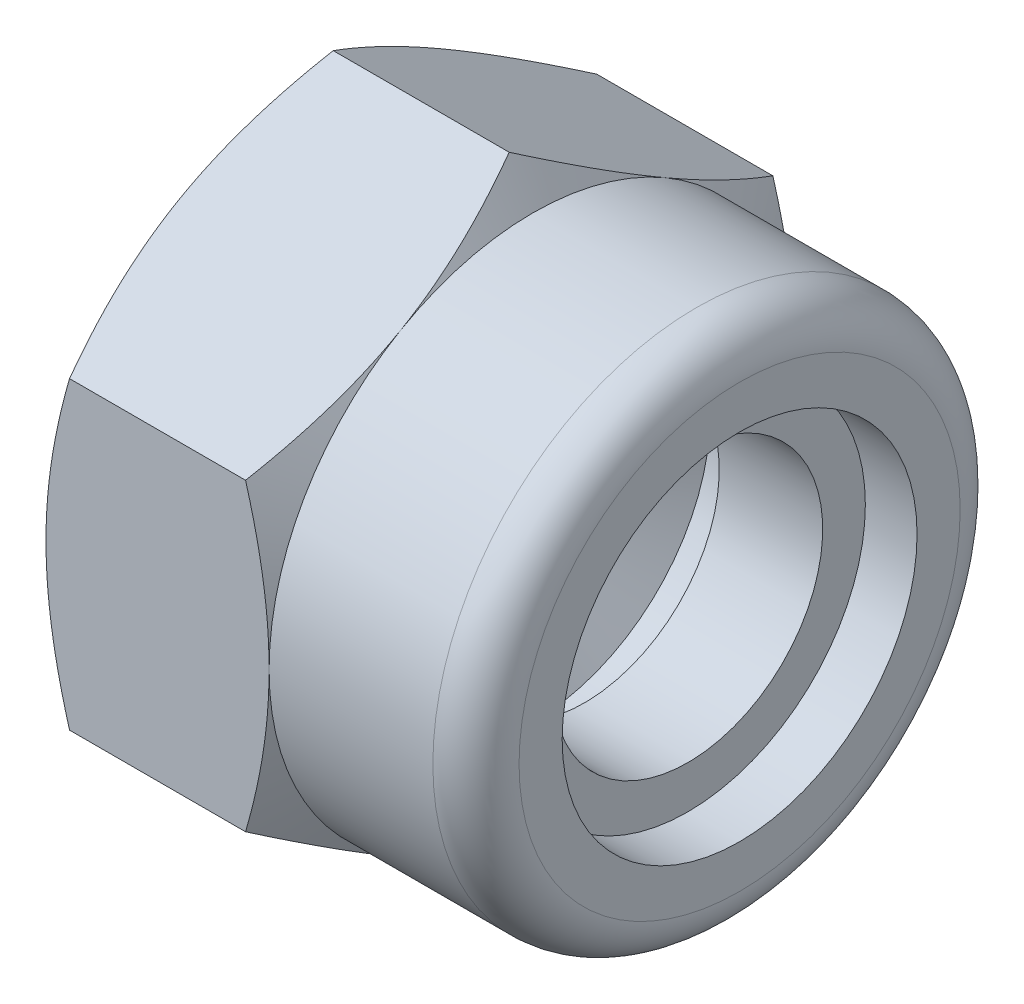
ISO-10303-21;
HEADER;
FILE_DESCRIPTION(('STEP AP214'),'2;1');
FILE_NAME('part.step','',(''),(''),'','','');
FILE_SCHEMA(('AUTOMOTIVE_DESIGN { 1 0 10303 214 1 1 1 1 }'));
ENDSEC;
DATA;
#1=APPLICATION_CONTEXT('core data for automotive mechanical design processes');
#2=APPLICATION_PROTOCOL_DEFINITION('international standard','automotive_design',2000,#1);
#3=PRODUCT_CONTEXT('',#1,'mechanical');
#4=PRODUCT('Part','Part','',(#3));
#5=PRODUCT_RELATED_PRODUCT_CATEGORY('part','',(#4));
#6=PRODUCT_DEFINITION_FORMATION('','',#4);
#7=PRODUCT_DEFINITION_CONTEXT('part definition',#1,'design');
#8=PRODUCT_DEFINITION('design','',#6,#7);
#9=PRODUCT_DEFINITION_SHAPE('','',#8);
#10=(LENGTH_UNIT() NAMED_UNIT(*) SI_UNIT(.MILLI.,.METRE.));
#11=(NAMED_UNIT(*) PLANE_ANGLE_UNIT() SI_UNIT($,.RADIAN.));
#12=(NAMED_UNIT(*) SI_UNIT($,.STERADIAN.) SOLID_ANGLE_UNIT());
#13=UNCERTAINTY_MEASURE_WITH_UNIT(LENGTH_MEASURE(1.E-05),#10,'distance_accuracy_value','');
#14=(GEOMETRIC_REPRESENTATION_CONTEXT(3) GLOBAL_UNCERTAINTY_ASSIGNED_CONTEXT((#13)) GLOBAL_UNIT_ASSIGNED_CONTEXT((#10,
#11,#12)) REPRESENTATION_CONTEXT('',''));
#15=CARTESIAN_POINT('',(0.,0.,0.));
#16=DIRECTION('',(0.,0.,1.));
#17=DIRECTION('',(1.,0.,0.));
#18=AXIS2_PLACEMENT_3D('',#15,#16,#17);
#19=CARTESIAN_POINT('',(4.89291619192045,0.,0.));
#20=DIRECTION('',(1.,0.,0.));
#21=DIRECTION('',(0.,0.,-1.));
#22=AXIS2_PLACEMENT_3D('',#19,#20,#21);
#23=CONICAL_SURFACE('',#22,3.32349999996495,1.04719755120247);
#24=CARTESIAN_POINT('',(5.5,0.,0.));
#25=DIRECTION('',(1.,0.,0.));
#26=DIRECTION('',(0.,1.,0.));
#27=AXIS2_PLACEMENT_3D('',#24,#25,#26);
#28=CIRCLE('',#27,4.375);
#29=CARTESIAN_POINT('',(5.5,4.375,0.));
#30=VERTEX_POINT('',#29);
#31=EDGE_CURVE('E361',#30,#30,#28,.F.);
#32=ORIENTED_EDGE('',*,*,#31,.F.);
#33=EDGE_LOOP('',(#32));
#34=FACE_BOUND('',#33,.T.);
#35=CARTESIAN_POINT('',(4.89291619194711,0.,0.));
#36=DIRECTION('',(1.,0.,0.));
#37=DIRECTION('',(0.,1.,0.));
#38=AXIS2_PLACEMENT_3D('',#35,#36,#37);
#39=CIRCLE('',#38,3.3235);
#40=CARTESIAN_POINT('',(4.89291619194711,3.3235,0.));
#41=VERTEX_POINT('',#40);
#42=EDGE_CURVE('E359',#41,#41,#39,.T.);
#43=ORIENTED_EDGE('',*,*,#42,.F.);
#44=EDGE_LOOP('',(#43));
#45=FACE_BOUND('',#44,.T.);
#46=ADVANCED_FACE('F16',(#34,#45),#23,.F.);
#47=CARTESIAN_POINT('',(6.775,0.,0.));
#48=DIRECTION('',(-1.,0.,0.));
#49=DIRECTION('',(0.,0.,1.));
#50=AXIS2_PLACEMENT_3D('',#47,#48,#49);
#51=CYLINDRICAL_SURFACE('',#50,4.375);
#52=CARTESIAN_POINT('',(6.775,0.,0.));
#53=DIRECTION('',(-1.,0.,0.));
#54=DIRECTION('',(0.,0.,1.));
#55=AXIS2_PLACEMENT_3D('',#52,#53,#54);
#56=CIRCLE('',#55,4.375);
#57=CARTESIAN_POINT('',(6.775,0.,4.375));
#58=VERTEX_POINT('',#57);
#59=EDGE_CURVE('E19',#58,#58,#56,.T.);
#60=ORIENTED_EDGE('',*,*,#59,.F.);
#61=EDGE_LOOP('',(#60));
#62=FACE_BOUND('',#61,.T.);
#63=ORIENTED_EDGE('',*,*,#31,.T.);
#64=EDGE_LOOP('',(#63));
#65=FACE_BOUND('',#64,.T.);
#66=ADVANCED_FACE('F365',(#62,#65),#51,.F.);
#67=CARTESIAN_POINT('',(4.89291619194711,0.,0.));
#68=DIRECTION('',(-1.,0.,0.));
#69=DIRECTION('',(0.,-1.,0.));
#70=AXIS2_PLACEMENT_3D('',#67,#68,#69);
#71=CYLINDRICAL_SURFACE('',#70,3.3235);
#72=ORIENTED_EDGE('',*,*,#42,.T.);
#73=EDGE_LOOP('',(#72));
#74=FACE_BOUND('',#73,.T.);
#75=CARTESIAN_POINT('',(0.60708380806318,0.,0.));
#76=DIRECTION('',(-1.,0.,0.));
#77=DIRECTION('',(0.,1.,0.));
#78=AXIS2_PLACEMENT_3D('',#75,#76,#77);
#79=CIRCLE('',#78,3.3235000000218);
#80=CARTESIAN_POINT('',(0.60708380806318,3.3235000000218,0.));
#81=VERTEX_POINT('',#80);
#82=EDGE_CURVE('E355',#81,#81,#79,.F.);
#83=ORIENTED_EDGE('',*,*,#82,.F.);
#84=EDGE_LOOP('',(#83));
#85=FACE_BOUND('',#84,.T.);
#86=ADVANCED_FACE('F371',(#74,#85),#71,.F.);
#87=CARTESIAN_POINT('',(6.775,3.84925,0.));
#88=DIRECTION('',(-1.,0.,0.));
#89=DIRECTION('',(0.,0.,1.));
#90=AXIS2_PLACEMENT_3D('',#87,#88,#89);
#91=PLANE('',#90);
#92=ORIENTED_EDGE('',*,*,#59,.T.);
#93=EDGE_LOOP('',(#92));
#94=FACE_BOUND('',#93,.T.);
#95=CARTESIAN_POINT('',(6.775,0.,0.));
#96=DIRECTION('',(-1.,0.,0.));
#97=DIRECTION('',(0.,0.,1.));
#98=AXIS2_PLACEMENT_3D('',#95,#96,#97);
#99=CIRCLE('',#98,3.3235);
#100=CARTESIAN_POINT('',(6.775,0.,3.3235));
#101=VERTEX_POINT('',#100);
#102=EDGE_CURVE('E358',#101,#101,#99,.T.);
#103=ORIENTED_EDGE('',*,*,#102,.F.);
#104=EDGE_LOOP('',(#103));
#105=FACE_BOUND('',#104,.T.);
#106=ADVANCED_FACE('F374',(#94,#105),#91,.T.);
#107=CARTESIAN_POINT('',(0.607083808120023,0.,0.));
#108=DIRECTION('',(-1.,0.,0.));
#109=DIRECTION('',(0.,-1.,0.));
#110=AXIS2_PLACEMENT_3D('',#107,#108,#109);
#111=CONICAL_SURFACE('',#110,3.32349999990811,1.04719755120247);
#112=ORIENTED_EDGE('',*,*,#82,.T.);
#113=EDGE_LOOP('',(#112));
#114=FACE_BOUND('',#113,.T.);
#115=CARTESIAN_POINT('',(-6.56373826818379E-11,0.,0.));
#116=DIRECTION('',(-1.,0.,0.));
#117=DIRECTION('',(0.,-1.,0.));
#118=AXIS2_PLACEMENT_3D('',#115,#116,#117);
#119=CIRCLE('',#118,4.37500000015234);
#120=CARTESIAN_POINT('',(-6.56376681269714E-11,-4.37500000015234,0.));
#121=VERTEX_POINT('',#120);
#122=EDGE_CURVE('E385',#121,#121,#119,.F.);
#123=ORIENTED_EDGE('',*,*,#122,.F.);
#124=EDGE_LOOP('',(#123));
#125=FACE_BOUND('',#124,.T.);
#126=ADVANCED_FACE('F378',(#114,#125),#111,.F.);
#127=CARTESIAN_POINT('',(9.325,0.,0.));
#128=DIRECTION('',(-1.,0.,0.));
#129=DIRECTION('',(0.,0.,1.));
#130=AXIS2_PLACEMENT_3D('',#127,#128,#129);
#131=CYLINDRICAL_SURFACE('',#130,3.3235);
#132=CARTESIAN_POINT('',(9.325,0.,0.));
#133=DIRECTION('',(-1.,0.,0.));
#134=DIRECTION('',(0.,0.,1.));
#135=AXIS2_PLACEMENT_3D('',#132,#133,#134);
#136=CIRCLE('',#135,3.3235);
#137=CARTESIAN_POINT('',(9.325,0.,3.3235));
#138=VERTEX_POINT('',#137);
#139=EDGE_CURVE('E114',#138,#138,#136,.T.);
#140=ORIENTED_EDGE('',*,*,#139,.F.);
#141=EDGE_LOOP('',(#140));
#142=FACE_BOUND('',#141,.T.);
#143=ORIENTED_EDGE('',*,*,#102,.T.);
#144=EDGE_LOOP('',(#143));
#145=FACE_BOUND('',#144,.T.);
#146=ADVANCED_FACE('F381',(#142,#145),#131,.F.);
#147=CARTESIAN_POINT('',(0.,5.4375,0.));
#148=DIRECTION('',(-1.,0.,0.));
#149=DIRECTION('',(0.,-1.,0.));
#150=AXIS2_PLACEMENT_3D('',#147,#148,#149);
#151=PLANE('',#150);
#152=CARTESIAN_POINT('',(0.,0.,0.));
#153=DIRECTION('',(1.,0.,0.));
#154=DIRECTION('',(0.,1.,0.));
#155=AXIS2_PLACEMENT_3D('',#152,#153,#154);
#156=CIRCLE('',#155,6.5);
#157=CARTESIAN_POINT('',(0.,0.,6.5));
#158=VERTEX_POINT('',#157);
#159=CARTESIAN_POINT('',(0.,-5.62916512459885,3.25));
#160=VERTEX_POINT('',#159);
#161=EDGE_CURVE('E131',#158,#160,#156,.T.);
#162=ORIENTED_EDGE('',*,*,#161,.F.);
#163=CARTESIAN_POINT('',(0.,0.,0.));
#164=DIRECTION('',(1.,0.,0.));
#165=DIRECTION('',(0.,1.,0.));
#166=AXIS2_PLACEMENT_3D('',#163,#164,#165);
#167=CIRCLE('',#166,6.5);
#168=CARTESIAN_POINT('',(0.,5.62916512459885,3.25));
#169=VERTEX_POINT('',#168);
#170=EDGE_CURVE('E132',#169,#158,#167,.T.);
#171=ORIENTED_EDGE('',*,*,#170,.F.);
#172=CARTESIAN_POINT('',(0.,0.,0.));
#173=DIRECTION('',(1.,0.,0.));
#174=DIRECTION('',(0.,1.,0.));
#175=AXIS2_PLACEMENT_3D('',#172,#173,#174);
#176=CIRCLE('',#175,6.5);
#177=CARTESIAN_POINT('',(0.,5.62916512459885,-3.25));
#178=VERTEX_POINT('',#177);
#179=EDGE_CURVE('E109',#178,#169,#176,.T.);
#180=ORIENTED_EDGE('',*,*,#179,.F.);
#181=CARTESIAN_POINT('',(0.,0.,0.));
#182=DIRECTION('',(1.,0.,0.));
#183=DIRECTION('',(0.,1.,0.));
#184=AXIS2_PLACEMENT_3D('',#181,#182,#183);
#185=CIRCLE('',#184,6.5);
#186=CARTESIAN_POINT('',(0.,0.,-6.5));
#187=VERTEX_POINT('',#186);
#188=EDGE_CURVE('E101',#187,#178,#185,.T.);
#189=ORIENTED_EDGE('',*,*,#188,.F.);
#190=CARTESIAN_POINT('',(0.,0.,0.));
#191=DIRECTION('',(1.,0.,0.));
#192=DIRECTION('',(0.,1.,0.));
#193=AXIS2_PLACEMENT_3D('',#190,#191,#192);
#194=CIRCLE('',#193,6.5);
#195=CARTESIAN_POINT('',(0.,-5.62916512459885,-3.25));
#196=VERTEX_POINT('',#195);
#197=EDGE_CURVE('E106',#196,#187,#194,.T.);
#198=ORIENTED_EDGE('',*,*,#197,.F.);
#199=CARTESIAN_POINT('',(0.,0.,0.));
#200=DIRECTION('',(1.,0.,0.));
#201=DIRECTION('',(0.,1.,0.));
#202=AXIS2_PLACEMENT_3D('',#199,#200,#201);
#203=CIRCLE('',#202,6.5);
#204=EDGE_CURVE('E123',#160,#196,#203,.T.);
#205=ORIENTED_EDGE('',*,*,#204,.F.);
#206=EDGE_LOOP('',(#162,#171,#180,#189,#198,#205));
#207=FACE_BOUND('',#206,.T.);
#208=ORIENTED_EDGE('',*,*,#122,.T.);
#209=EDGE_LOOP('',(#208));
#210=FACE_BOUND('',#209,.T.);
#211=ADVANCED_FACE('F103',(#207,#210),#151,.T.);
#212=CARTESIAN_POINT('',(9.325,3.84925,0.));
#213=DIRECTION('',(1.,0.,0.));
#214=DIRECTION('',(0.,0.,-1.));
#215=AXIS2_PLACEMENT_3D('',#212,#213,#214);
#216=PLANE('',#215);
#217=ORIENTED_EDGE('',*,*,#139,.T.);
#218=EDGE_LOOP('',(#217));
#219=FACE_BOUND('',#218,.T.);
#220=CARTESIAN_POINT('',(9.325,0.,0.));
#221=DIRECTION('',(-1.,0.,0.));
#222=DIRECTION('',(0.,0.,1.));
#223=AXIS2_PLACEMENT_3D('',#220,#221,#222);
#224=CIRCLE('',#223,4.375);
#225=CARTESIAN_POINT('',(9.325,0.,4.375));
#226=VERTEX_POINT('',#225);
#227=EDGE_CURVE('E137',#226,#226,#224,.T.);
#228=ORIENTED_EDGE('',*,*,#227,.F.);
#229=EDGE_LOOP('',(#228));
#230=FACE_BOUND('',#229,.T.);
#231=ADVANCED_FACE('F481',(#219,#230),#216,.T.);
#232=CARTESIAN_POINT('',(0.584039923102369,0.,0.));
#233=DIRECTION('',(1.,0.,0.));
#234=DIRECTION('',(0.,1.,0.));
#235=AXIS2_PLACEMENT_3D('',#232,#233,#234);
#236=CONICAL_SURFACE('',#235,7.51158682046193,1.0471975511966);
#237=ORIENTED_EDGE('',*,*,#188,.T.);
#238=CARTESIAN_POINT('',(0.,5.62916512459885,-3.25));
#239=CARTESIAN_POINT('',(-2.65652577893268E-05,5.54952296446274,-3.38794426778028));
#240=CARTESIAN_POINT('',(0.00337972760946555,5.46988464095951,-3.52588189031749));
#241=CARTESIAN_POINT('',(0.0168605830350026,5.31076436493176,-3.80148629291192));
#242=CARTESIAN_POINT('',(0.0269338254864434,5.23128238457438,-3.9391531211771));
#243=CARTESIAN_POINT('',(0.0534848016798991,5.07298818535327,-4.2133267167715));
#244=CARTESIAN_POINT('',(0.0699302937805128,4.99417460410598,-4.34983584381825));
#245=CARTESIAN_POINT('',(0.108872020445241,4.83692293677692,-4.6222037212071));
#246=CARTESIAN_POINT('',(0.131368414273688,4.75848486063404,-4.75806245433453));
#247=CARTESIAN_POINT('',(0.207238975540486,4.52405902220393,-5.16409991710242));
#248=CARTESIAN_POINT('',(0.269031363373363,4.36875227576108,-5.43309909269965));
#249=CARTESIAN_POINT('',(0.41154041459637,4.05947435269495,-5.96878416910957));
#250=CARTESIAN_POINT('',(0.492351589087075,3.90551396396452,-6.23545138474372));
#251=CARTESIAN_POINT('',(0.580556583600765,3.75277674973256,-6.5));
#252=B_SPLINE_CURVE_WITH_KNOTS('',3,(#238,#239,#240,#241,#242,#243,#244,#245,#246,#247,#248,
#249,#250,#251),.UNSPECIFIED.,.F.,.F.,(4,2,2,2,2,2,4),(0.,0.477804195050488,0.955513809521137,
1.43083727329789,1.906173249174,2.85559935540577,3.80984701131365),.UNSPECIFIED.);
#253=CARTESIAN_POINT('',(0.580556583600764,3.75277674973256,-6.5));
#254=VERTEX_POINT('',#253);
#255=EDGE_CURVE('E118',#178,#254,#252,.T.);
#256=ORIENTED_EDGE('',*,*,#255,.T.);
#257=CARTESIAN_POINT('',(0.580556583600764,3.75277674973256,-6.5));
#258=CARTESIAN_POINT('',(0.492351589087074,3.44730232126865,-6.5));
#259=CARTESIAN_POINT('',(0.411540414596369,3.1393815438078,-6.5));
#260=CARTESIAN_POINT('',(0.269031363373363,2.52082569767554,-6.5));
#261=CARTESIAN_POINT('',(0.207238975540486,2.21021220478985,-6.5));
#262=CARTESIAN_POINT('',(0.131368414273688,1.74136052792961,-6.5));
#263=CARTESIAN_POINT('',(0.108872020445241,1.58448437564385,-6.5));
#264=CARTESIAN_POINT('',(0.0699302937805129,1.26998104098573,-6.5));
#265=CARTESIAN_POINT('',(0.0534848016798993,1.11235387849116,-6.5));
#266=CARTESIAN_POINT('',(0.0269338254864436,0.795765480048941,-6.5));
#267=CARTESIAN_POINT('',(0.0168605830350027,0.636801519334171,-6.5));
#268=CARTESIAN_POINT('',(0.0033797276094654,0.318560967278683,-6.5));
#269=CARTESIAN_POINT('',(-2.6565257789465E-05,0.159284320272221,-6.5));
#270=CARTESIAN_POINT('',(0.,0.,-6.5));
#271=B_SPLINE_CURVE_WITH_KNOTS('',3,(#257,#258,#259,#260,#261,#262,#263,#264,#265,#266,#267,
#268,#269,#270),.UNSPECIFIED.,.F.,.F.,(4,2,2,2,2,2,4),(0.,0.954247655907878,1.90367376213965,
2.37900973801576,2.85433320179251,3.33204281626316,3.80984701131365),.UNSPECIFIED.);
#272=EDGE_CURVE('E116',#254,#187,#271,.T.);
#273=ORIENTED_EDGE('',*,*,#272,.T.);
#274=EDGE_LOOP('',(#237,#256,#273));
#275=FACE_BOUND('',#274,.T.);
#276=ADVANCED_FACE('F117',(#275),#236,.T.);
#277=CARTESIAN_POINT('',(0.584039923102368,0.,0.));
#278=DIRECTION('',(1.,0.,0.));
#279=DIRECTION('',(0.,1.,0.));
#280=AXIS2_PLACEMENT_3D('',#277,#278,#279);
#281=CONICAL_SURFACE('',#280,7.51158682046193,1.0471975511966);
#282=CARTESIAN_POINT('',(0.580556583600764,7.50555349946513,0.));
#283=CARTESIAN_POINT('',(0.492351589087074,7.35281628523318,-0.264548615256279));
#284=CARTESIAN_POINT('',(0.411540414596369,7.19885589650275,-0.531215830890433));
#285=CARTESIAN_POINT('',(0.269031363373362,6.88957797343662,-1.06690090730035));
#286=CARTESIAN_POINT('',(0.207238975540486,6.73427122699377,-1.33590008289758));
#287=CARTESIAN_POINT('',(0.131368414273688,6.49984538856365,-1.74193754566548));
#288=CARTESIAN_POINT('',(0.10887202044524,6.42140731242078,-1.8777962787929));
#289=CARTESIAN_POINT('',(0.0699302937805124,6.26415564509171,-2.15016415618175));
#290=CARTESIAN_POINT('',(0.0534848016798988,6.18534206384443,-2.28667328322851));
#291=CARTESIAN_POINT('',(0.0269338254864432,6.02704786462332,-2.5608468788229));
#292=CARTESIAN_POINT('',(0.0168605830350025,5.94756588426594,-2.69851370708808));
#293=CARTESIAN_POINT('',(0.00337972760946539,5.78844560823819,-2.97411810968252));
#294=CARTESIAN_POINT('',(-2.65652577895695E-05,5.70880728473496,-3.11205573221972));
#295=CARTESIAN_POINT('',(0.,5.62916512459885,-3.25));
#296=B_SPLINE_CURVE_WITH_KNOTS('',3,(#282,#283,#284,#285,#286,#287,#288,#289,#290,#291,#292,
#293,#294,#295),.UNSPECIFIED.,.F.,.F.,(4,2,2,2,2,2,4),(0.,0.95424765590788,1.90367376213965,
2.37900973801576,2.85433320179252,3.33204281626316,3.80984701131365),.UNSPECIFIED.);
#297=CARTESIAN_POINT('',(0.580556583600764,7.50555349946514,0.));
#298=VERTEX_POINT('',#297);
#299=EDGE_CURVE('E352',#298,#178,#296,.T.);
#300=ORIENTED_EDGE('',*,*,#299,.T.);
#301=ORIENTED_EDGE('',*,*,#179,.T.);
#302=CARTESIAN_POINT('',(0.,5.62916512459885,3.25));
#303=CARTESIAN_POINT('',(-2.65652577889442E-05,5.70880728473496,3.11205573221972));
#304=CARTESIAN_POINT('',(0.0033797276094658,5.78844560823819,2.97411810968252));
#305=CARTESIAN_POINT('',(0.0168605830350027,5.94756588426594,2.69851370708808));
#306=CARTESIAN_POINT('',(0.0269338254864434,6.02704786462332,2.5608468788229));
#307=CARTESIAN_POINT('',(0.0534848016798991,6.18534206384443,2.28667328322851));
#308=CARTESIAN_POINT('',(0.069930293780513,6.26415564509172,2.15016415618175));
#309=CARTESIAN_POINT('',(0.108872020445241,6.42140731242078,1.8777962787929));
#310=CARTESIAN_POINT('',(0.131368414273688,6.49984538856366,1.74193754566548));
#311=CARTESIAN_POINT('',(0.207238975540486,6.73427122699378,1.33590008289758));
#312=CARTESIAN_POINT('',(0.269031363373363,6.88957797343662,1.06690090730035));
#313=CARTESIAN_POINT('',(0.41154041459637,7.19885589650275,0.531215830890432));
#314=CARTESIAN_POINT('',(0.492351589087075,7.35281628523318,0.264548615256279));
#315=CARTESIAN_POINT('',(0.580556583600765,7.50555349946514,0.));
#316=B_SPLINE_CURVE_WITH_KNOTS('',3,(#302,#303,#304,#305,#306,#307,#308,#309,#310,#311,#312,
#313,#314,#315),.UNSPECIFIED.,.F.,.F.,(4,2,2,2,2,2,4),(0.,0.477804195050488,0.955513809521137,
1.43083727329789,1.906173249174,2.85559935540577,3.80984701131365),.UNSPECIFIED.);
#317=EDGE_CURVE('E348',#169,#298,#316,.T.);
#318=ORIENTED_EDGE('',*,*,#317,.T.);
#319=EDGE_LOOP('',(#300,#301,#318));
#320=FACE_BOUND('',#319,.T.);
#321=ADVANCED_FACE('F480',(#320),#281,.T.);
#322=CARTESIAN_POINT('',(0.584039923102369,0.,0.));
#323=DIRECTION('',(1.,0.,0.));
#324=DIRECTION('',(0.,1.,0.));
#325=AXIS2_PLACEMENT_3D('',#322,#323,#324);
#326=CONICAL_SURFACE('',#325,7.51158682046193,1.0471975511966);
#327=CARTESIAN_POINT('',(0.580556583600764,3.75277674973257,6.5));
#328=CARTESIAN_POINT('',(0.492351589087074,3.90551396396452,6.23545138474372));
#329=CARTESIAN_POINT('',(0.411540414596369,4.05947435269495,5.96878416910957));
#330=CARTESIAN_POINT('',(0.269031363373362,4.36875227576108,5.43309909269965));
#331=CARTESIAN_POINT('',(0.207238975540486,4.52405902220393,5.16409991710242));
#332=CARTESIAN_POINT('',(0.131368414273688,4.75848486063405,4.75806245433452));
#333=CARTESIAN_POINT('',(0.108872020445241,4.83692293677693,4.6222037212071));
#334=CARTESIAN_POINT('',(0.0699302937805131,4.99417460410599,4.34983584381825));
#335=CARTESIAN_POINT('',(0.0534848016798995,5.07298818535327,4.21332671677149));
#336=CARTESIAN_POINT('',(0.0269338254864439,5.23128238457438,3.9391531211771));
#337=CARTESIAN_POINT('',(0.0168605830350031,5.31076436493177,3.80148629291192));
#338=CARTESIAN_POINT('',(0.00337972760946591,5.46988464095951,3.52588189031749));
#339=CARTESIAN_POINT('',(-2.65652577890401E-05,5.54952296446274,3.38794426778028));
#340=CARTESIAN_POINT('',(0.,5.62916512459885,3.25));
#341=B_SPLINE_CURVE_WITH_KNOTS('',3,(#327,#328,#329,#330,#331,#332,#333,#334,#335,#336,#337,
#338,#339,#340),.UNSPECIFIED.,.F.,.F.,(4,2,2,2,2,2,4),(0.,0.954247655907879,1.90367376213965,
2.37900973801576,2.85433320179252,3.33204281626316,3.80984701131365),.UNSPECIFIED.);
#342=CARTESIAN_POINT('',(0.580556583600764,3.75277674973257,6.5));
#343=VERTEX_POINT('',#342);
#344=EDGE_CURVE('E269',#343,#169,#341,.T.);
#345=ORIENTED_EDGE('',*,*,#344,.T.);
#346=ORIENTED_EDGE('',*,*,#170,.T.);
#347=CARTESIAN_POINT('',(0.,0.,6.5));
#348=CARTESIAN_POINT('',(-2.6565257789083E-05,0.159284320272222,6.5));
#349=CARTESIAN_POINT('',(0.00337972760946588,0.318560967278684,6.5));
#350=CARTESIAN_POINT('',(0.016860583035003,0.636801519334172,6.5));
#351=CARTESIAN_POINT('',(0.0269338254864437,0.795765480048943,6.5));
#352=CARTESIAN_POINT('',(0.0534848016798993,1.11235387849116,6.5));
#353=CARTESIAN_POINT('',(0.0699302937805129,1.26998104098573,6.5));
#354=CARTESIAN_POINT('',(0.108872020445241,1.58448437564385,6.5));
#355=CARTESIAN_POINT('',(0.131368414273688,1.74136052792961,6.5));
#356=CARTESIAN_POINT('',(0.207238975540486,2.21021220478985,6.5));
#357=CARTESIAN_POINT('',(0.269031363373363,2.52082569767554,6.5));
#358=CARTESIAN_POINT('',(0.41154041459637,3.1393815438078,6.5));
#359=CARTESIAN_POINT('',(0.492351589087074,3.44730232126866,6.5));
#360=CARTESIAN_POINT('',(0.580556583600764,3.75277674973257,6.5));
#361=B_SPLINE_CURVE_WITH_KNOTS('',3,(#347,#348,#349,#350,#351,#352,#353,#354,#355,#356,#357,
#358,#359,#360),.UNSPECIFIED.,.F.,.F.,(4,2,2,2,2,2,4),(0.,0.477804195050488,0.955513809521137,
1.43083727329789,1.906173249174,2.85559935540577,3.80984701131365),.UNSPECIFIED.);
#362=EDGE_CURVE('E342',#158,#343,#361,.T.);
#363=ORIENTED_EDGE('',*,*,#362,.T.);
#364=EDGE_LOOP('',(#345,#346,#363));
#365=FACE_BOUND('',#364,.T.);
#366=ADVANCED_FACE('F161',(#365),#326,.T.);
#367=CARTESIAN_POINT('',(0.584039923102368,0.,0.));
#368=DIRECTION('',(1.,0.,0.));
#369=DIRECTION('',(0.,1.,0.));
#370=AXIS2_PLACEMENT_3D('',#367,#368,#369);
#371=CONICAL_SURFACE('',#370,7.51158682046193,1.0471975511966);
#372=ORIENTED_EDGE('',*,*,#197,.T.);
#373=CARTESIAN_POINT('',(0.,0.,-6.5));
#374=CARTESIAN_POINT('',(-2.65652577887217E-05,-0.159284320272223,-6.5));
#375=CARTESIAN_POINT('',(0.00337972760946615,-0.318560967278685,-6.5));
#376=CARTESIAN_POINT('',(0.016860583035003,-0.636801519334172,-6.5));
#377=CARTESIAN_POINT('',(0.0269338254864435,-0.795765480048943,-6.5));
#378=CARTESIAN_POINT('',(0.053484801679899,-1.11235387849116,-6.5));
#379=CARTESIAN_POINT('',(0.0699302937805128,-1.26998104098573,-6.5));
#380=CARTESIAN_POINT('',(0.108872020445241,-1.58448437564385,-6.5));
#381=CARTESIAN_POINT('',(0.131368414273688,-1.74136052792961,-6.5));
#382=CARTESIAN_POINT('',(0.207238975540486,-2.21021220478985,-6.5));
#383=CARTESIAN_POINT('',(0.269031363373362,-2.52082569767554,-6.5));
#384=CARTESIAN_POINT('',(0.411540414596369,-3.1393815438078,-6.5));
#385=CARTESIAN_POINT('',(0.492351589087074,-3.44730232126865,-6.5));
#386=CARTESIAN_POINT('',(0.580556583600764,-3.75277674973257,-6.5));
#387=B_SPLINE_CURVE_WITH_KNOTS('',3,(#373,#374,#375,#376,#377,#378,#379,#380,#381,#382,#383,
#384,#385,#386),.UNSPECIFIED.,.F.,.F.,(4,2,2,2,2,2,4),(0.,0.477804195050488,0.955513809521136,
1.43083727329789,1.906173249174,2.85559935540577,3.80984701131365),.UNSPECIFIED.);
#388=CARTESIAN_POINT('',(0.580556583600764,-3.75277674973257,-6.5));
#389=VERTEX_POINT('',#388);
#390=EDGE_CURVE('E122',#187,#389,#387,.T.);
#391=ORIENTED_EDGE('',*,*,#390,.T.);
#392=CARTESIAN_POINT('',(0.580556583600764,-3.75277674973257,-6.5));
#393=CARTESIAN_POINT('',(0.492351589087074,-3.90551396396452,-6.23545138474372));
#394=CARTESIAN_POINT('',(0.411540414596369,-4.05947435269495,-5.96878416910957));
#395=CARTESIAN_POINT('',(0.269031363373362,-4.36875227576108,-5.43309909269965));
#396=CARTESIAN_POINT('',(0.207238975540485,-4.52405902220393,-5.16409991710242));
#397=CARTESIAN_POINT('',(0.131368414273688,-4.75848486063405,-4.75806245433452));
#398=CARTESIAN_POINT('',(0.10887202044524,-4.83692293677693,-4.6222037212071));
#399=CARTESIAN_POINT('',(0.069930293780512,-4.99417460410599,-4.34983584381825));
#400=CARTESIAN_POINT('',(0.0534848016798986,-5.07298818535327,-4.21332671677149));
#401=CARTESIAN_POINT('',(0.0269338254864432,-5.23128238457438,-3.9391531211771));
#402=CARTESIAN_POINT('',(0.0168605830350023,-5.31076436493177,-3.80148629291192));
#403=CARTESIAN_POINT('',(0.00337972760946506,-5.46988464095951,-3.52588189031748));
#404=CARTESIAN_POINT('',(-2.6565257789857E-05,-5.54952296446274,-3.38794426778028));
#405=CARTESIAN_POINT('',(0.,-5.62916512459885,-3.25));
#406=B_SPLINE_CURVE_WITH_KNOTS('',3,(#392,#393,#394,#395,#396,#397,#398,#399,#400,#401,#402,
#403,#404,#405),.UNSPECIFIED.,.F.,.F.,(4,2,2,2,2,2,4),(0.,0.95424765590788,1.90367376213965,
2.37900973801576,2.85433320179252,3.33204281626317,3.80984701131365),.UNSPECIFIED.);
#407=EDGE_CURVE('E129',#389,#196,#406,.T.);
#408=ORIENTED_EDGE('',*,*,#407,.T.);
#409=EDGE_LOOP('',(#372,#391,#408));
#410=FACE_BOUND('',#409,.T.);
#411=ADVANCED_FACE('F126',(#410),#371,.T.);
#412=CARTESIAN_POINT('',(0.584039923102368,0.,0.));
#413=DIRECTION('',(1.,0.,0.));
#414=DIRECTION('',(0.,1.,0.));
#415=AXIS2_PLACEMENT_3D('',#412,#413,#414);
#416=CONICAL_SURFACE('',#415,7.51158682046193,1.0471975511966);
#417=CARTESIAN_POINT('',(0.580556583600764,-3.75277674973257,6.5));
#418=CARTESIAN_POINT('',(0.492351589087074,-3.44730232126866,6.5));
#419=CARTESIAN_POINT('',(0.411540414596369,-3.1393815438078,6.5));
#420=CARTESIAN_POINT('',(0.269031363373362,-2.52082569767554,6.5));
#421=CARTESIAN_POINT('',(0.207238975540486,-2.21021220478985,6.5));
#422=CARTESIAN_POINT('',(0.131368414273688,-1.74136052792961,6.5));
#423=CARTESIAN_POINT('',(0.108872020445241,-1.58448437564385,6.5));
#424=CARTESIAN_POINT('',(0.0699302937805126,-1.26998104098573,6.5));
#425=CARTESIAN_POINT('',(0.0534848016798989,-1.11235387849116,6.5));
#426=CARTESIAN_POINT('',(0.0269338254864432,-0.795765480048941,6.5));
#427=CARTESIAN_POINT('',(0.0168605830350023,-0.636801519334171,6.5));
#428=CARTESIAN_POINT('',(0.00337972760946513,-0.318560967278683,6.5));
#429=CARTESIAN_POINT('',(-2.65652577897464E-05,-0.159284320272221,6.5));
#430=CARTESIAN_POINT('',(0.,0.,6.5));
#431=B_SPLINE_CURVE_WITH_KNOTS('',3,(#417,#418,#419,#420,#421,#422,#423,#424,#425,#426,#427,
#428,#429,#430),.UNSPECIFIED.,.F.,.F.,(4,2,2,2,2,2,4),(0.,0.954247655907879,1.90367376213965,
2.37900973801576,2.85433320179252,3.33204281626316,3.80984701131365),.UNSPECIFIED.);
#432=CARTESIAN_POINT('',(0.580556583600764,-3.75277674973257,6.5));
#433=VERTEX_POINT('',#432);
#434=EDGE_CURVE('E178',#433,#158,#431,.T.);
#435=ORIENTED_EDGE('',*,*,#434,.T.);
#436=ORIENTED_EDGE('',*,*,#161,.T.);
#437=CARTESIAN_POINT('',(0.,-5.62916512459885,3.25));
#438=CARTESIAN_POINT('',(-2.65652577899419E-05,-5.54952296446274,3.38794426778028));
#439=CARTESIAN_POINT('',(0.00337972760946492,-5.46988464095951,3.52588189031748));
#440=CARTESIAN_POINT('',(0.0168605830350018,-5.31076436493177,3.80148629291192));
#441=CARTESIAN_POINT('',(0.0269338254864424,-5.23128238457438,3.9391531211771));
#442=CARTESIAN_POINT('',(0.0534848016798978,-5.07298818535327,4.21332671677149));
#443=CARTESIAN_POINT('',(0.0699302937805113,-4.99417460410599,4.34983584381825));
#444=CARTESIAN_POINT('',(0.10887202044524,-4.83692293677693,4.6222037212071));
#445=CARTESIAN_POINT('',(0.131368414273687,-4.75848486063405,4.75806245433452));
#446=CARTESIAN_POINT('',(0.207238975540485,-4.52405902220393,5.16409991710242));
#447=CARTESIAN_POINT('',(0.269031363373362,-4.36875227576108,5.43309909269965));
#448=CARTESIAN_POINT('',(0.411540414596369,-4.05947435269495,5.96878416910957));
#449=CARTESIAN_POINT('',(0.492351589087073,-3.90551396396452,6.23545138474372));
#450=CARTESIAN_POINT('',(0.580556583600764,-3.75277674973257,6.5));
#451=B_SPLINE_CURVE_WITH_KNOTS('',3,(#437,#438,#439,#440,#441,#442,#443,#444,#445,#446,#447,
#448,#449,#450),.UNSPECIFIED.,.F.,.F.,(4,2,2,2,2,2,4),(0.,0.477804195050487,0.955513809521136,
1.43083727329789,1.906173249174,2.85559935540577,3.80984701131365),.UNSPECIFIED.);
#452=EDGE_CURVE('E329',#160,#433,#451,.T.);
#453=ORIENTED_EDGE('',*,*,#452,.T.);
#454=EDGE_LOOP('',(#435,#436,#453));
#455=FACE_BOUND('',#454,.T.);
#456=ADVANCED_FACE('F160',(#455),#416,.T.);
#457=CARTESIAN_POINT('',(0.584039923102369,0.,0.));
#458=DIRECTION('',(1.,0.,0.));
#459=DIRECTION('',(0.,1.,0.));
#460=AXIS2_PLACEMENT_3D('',#457,#458,#459);
#461=CONICAL_SURFACE('',#460,7.51158682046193,1.0471975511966);
#462=ORIENTED_EDGE('',*,*,#204,.T.);
#463=CARTESIAN_POINT('',(0.,-5.62916512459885,-3.25));
#464=CARTESIAN_POINT('',(-2.65652577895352E-05,-5.70880728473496,-3.11205573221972));
#465=CARTESIAN_POINT('',(0.00337972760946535,-5.78844560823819,-2.97411810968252));
#466=CARTESIAN_POINT('',(0.0168605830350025,-5.94756588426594,-2.69851370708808));
#467=CARTESIAN_POINT('',(0.0269338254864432,-6.02704786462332,-2.5608468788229));
#468=CARTESIAN_POINT('',(0.0534848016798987,-6.18534206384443,-2.28667328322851));
#469=CARTESIAN_POINT('',(0.0699302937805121,-6.26415564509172,-2.15016415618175));
#470=CARTESIAN_POINT('',(0.10887202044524,-6.42140731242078,-1.8777962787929));
#471=CARTESIAN_POINT('',(0.131368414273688,-6.49984538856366,-1.74193754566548));
#472=CARTESIAN_POINT('',(0.207238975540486,-6.73427122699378,-1.33590008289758));
#473=CARTESIAN_POINT('',(0.269031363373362,-6.88957797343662,-1.06690090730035));
#474=CARTESIAN_POINT('',(0.411540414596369,-7.19885589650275,-0.531215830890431));
#475=CARTESIAN_POINT('',(0.492351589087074,-7.35281628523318,-0.264548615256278));
#476=CARTESIAN_POINT('',(0.580556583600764,-7.50555349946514,0.));
#477=B_SPLINE_CURVE_WITH_KNOTS('',3,(#463,#464,#465,#466,#467,#468,#469,#470,#471,#472,#473,
#474,#475,#476),.UNSPECIFIED.,.F.,.F.,(4,2,2,2,2,2,4),(0.,0.477804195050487,0.955513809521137,
1.43083727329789,1.906173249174,2.85559935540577,3.80984701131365),.UNSPECIFIED.);
#478=CARTESIAN_POINT('',(0.580556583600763,-7.50555349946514,0.));
#479=VERTEX_POINT('',#478);
#480=EDGE_CURVE('E173',#196,#479,#477,.T.);
#481=ORIENTED_EDGE('',*,*,#480,.T.);
#482=CARTESIAN_POINT('',(0.580556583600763,-7.50555349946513,0.));
#483=CARTESIAN_POINT('',(0.492351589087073,-7.35281628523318,0.264548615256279));
#484=CARTESIAN_POINT('',(0.411540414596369,-7.19885589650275,0.531215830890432));
#485=CARTESIAN_POINT('',(0.269031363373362,-6.88957797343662,1.06690090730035));
#486=CARTESIAN_POINT('',(0.207238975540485,-6.73427122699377,1.33590008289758));
#487=CARTESIAN_POINT('',(0.131368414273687,-6.49984538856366,1.74193754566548));
#488=CARTESIAN_POINT('',(0.10887202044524,-6.42140731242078,1.8777962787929));
#489=CARTESIAN_POINT('',(0.0699302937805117,-6.26415564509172,2.15016415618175));
#490=CARTESIAN_POINT('',(0.0534848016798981,-6.18534206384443,2.28667328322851));
#491=CARTESIAN_POINT('',(0.0269338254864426,-6.02704786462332,2.5608468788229));
#492=CARTESIAN_POINT('',(0.0168605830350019,-5.94756588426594,2.69851370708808));
#493=CARTESIAN_POINT('',(0.00337972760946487,-5.78844560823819,2.97411810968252));
#494=CARTESIAN_POINT('',(-2.65652577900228E-05,-5.70880728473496,3.11205573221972));
#495=CARTESIAN_POINT('',(0.,-5.62916512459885,3.25));
#496=B_SPLINE_CURVE_WITH_KNOTS('',3,(#482,#483,#484,#485,#486,#487,#488,#489,#490,#491,#492,
#493,#494,#495),.UNSPECIFIED.,.F.,.F.,(4,2,2,2,2,2,4),(0.,0.954247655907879,1.90367376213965,
2.37900973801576,2.85433320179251,3.33204281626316,3.80984701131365),.UNSPECIFIED.);
#497=EDGE_CURVE('E325',#479,#160,#496,.T.);
#498=ORIENTED_EDGE('',*,*,#497,.T.);
#499=EDGE_LOOP('',(#462,#481,#498));
#500=FACE_BOUND('',#499,.T.);
#501=ADVANCED_FACE('F398',(#500),#461,.T.);
#502=CARTESIAN_POINT('',(11.6,3.75277674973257,-6.5));
#503=DIRECTION('',(0.,0.,1.));
#504=DIRECTION('',(1.,0.,0.));
#505=AXIS2_PLACEMENT_3D('',#502,#503,#504);
#506=PLANE('',#505);
#507=ORIENTED_EDGE('',*,*,#272,.F.);
#508=DIRECTION('',(1.,0.,0.));
#509=VECTOR('',#508,1.);
#510=CARTESIAN_POINT('',(11.6,3.75277674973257,-6.5));
#511=LINE('',#510,#509);
#512=CARTESIAN_POINT('',(4.91944341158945,3.75277674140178,-6.50000001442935));
#513=VERTEX_POINT('',#512);
#514=EDGE_CURVE('E140',#254,#513,#511,.T.);
#515=ORIENTED_EDGE('',*,*,#514,.T.);
#516=CARTESIAN_POINT('',(5.5,0.,-6.5));
#517=CARTESIAN_POINT('',(5.5000265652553,0.159284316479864,-6.5));
#518=CARTESIAN_POINT('',(5.49662027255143,0.318560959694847,-6.5));
#519=CARTESIAN_POINT('',(5.48313941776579,0.636801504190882,-6.5));
#520=CARTESIAN_POINT('',(5.47306617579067,0.795765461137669,-6.5));
#521=CARTESIAN_POINT('',(5.44651520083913,1.11235385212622,-6.5));
#522=CARTESIAN_POINT('',(5.43006970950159,1.26998101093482,-6.5));
#523=CARTESIAN_POINT('',(5.39112798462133,1.58448433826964,-6.5));
#524=CARTESIAN_POINT('',(5.36863159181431,1.74136048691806,-6.5));
#525=CARTESIAN_POINT('',(5.2927610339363,2.21021215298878,-6.5));
#526=CARTESIAN_POINT('',(5.23096864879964,2.52082563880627,-6.5));
#527=CARTESIAN_POINT('',(5.08845960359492,3.13938147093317,-6.5));
#528=CARTESIAN_POINT('',(5.00764843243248,3.44730224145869,-6.5));
#529=CARTESIAN_POINT('',(4.91944344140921,3.75277666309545,-6.5));
#530=B_SPLINE_CURVE_WITH_KNOTS('',3,(#516,#517,#518,#519,#520,#521,#522,#523,#524,#525,#526,
#527,#528,#529),.UNSPECIFIED.,.F.,.F.,(4,2,2,2,2,2,4),(0.,0.477804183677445,0.955513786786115,
1.4308372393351,1.90617320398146,2.85559928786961,3.80984692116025),.UNSPECIFIED.);
#531=CARTESIAN_POINT('',(5.5,0.,-6.5));
#532=VERTEX_POINT('',#531);
#533=EDGE_CURVE('E434',#532,#513,#530,.T.);
#534=ORIENTED_EDGE('',*,*,#533,.F.);
#535=CARTESIAN_POINT('',(4.91944340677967,-3.75277678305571,-6.5));
#536=CARTESIAN_POINT('',(5.00764840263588,-3.44730235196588,-6.5));
#537=CARTESIAN_POINT('',(5.08845957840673,-3.1393815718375,-6.5));
#538=CARTESIAN_POINT('',(5.23096863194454,-2.52082572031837,-6.5));
#539=CARTESIAN_POINT('',(5.29276102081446,-2.21021222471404,-6.5));
#540=CARTESIAN_POINT('',(5.36863158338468,-1.74136054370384,-6.5));
#541=CARTESIAN_POINT('',(5.391127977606,-1.58448439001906,-6.5));
#542=CARTESIAN_POINT('',(5.43006970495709,-1.26998105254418,-6.5));
#543=CARTESIAN_POINT('',(5.44651519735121,-1.11235388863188,-6.5));
#544=CARTESIAN_POINT('',(5.47306617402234,-0.795765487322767,-6.5));
#545=CARTESIAN_POINT('',(5.48313941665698,-0.636801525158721,-6.5));
#546=CARTESIAN_POINT('',(5.49662027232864,-0.318560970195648,-6.5));
#547=CARTESIAN_POINT('',(5.50002656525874,-0.159284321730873,-6.5));
#548=CARTESIAN_POINT('',(5.5,0.,-6.5));
#549=B_SPLINE_CURVE_WITH_KNOTS('',3,(#535,#536,#537,#538,#539,#540,#541,#542,#543,#544,#545,
#546,#547,#548),.UNSPECIFIED.,.F.,.F.,(4,2,2,2,2,2,4),(0.,0.954247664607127,1.9036737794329,
2.3790097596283,2.85433322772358,3.33204284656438,3.80984704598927),.UNSPECIFIED.);
#550=CARTESIAN_POINT('',(4.91944341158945,-3.75277676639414,-6.5));
#551=VERTEX_POINT('',#550);
#552=EDGE_CURVE('E442',#551,#532,#549,.T.);
#553=ORIENTED_EDGE('',*,*,#552,.F.);
#554=DIRECTION('',(1.,0.,0.));
#555=VECTOR('',#554,1.);
#556=CARTESIAN_POINT('',(11.6,-3.75277674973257,-6.5));
#557=LINE('',#556,#555);
#558=EDGE_CURVE('E136',#551,#389,#557,.F.);
#559=ORIENTED_EDGE('',*,*,#558,.T.);
#560=ORIENTED_EDGE('',*,*,#390,.F.);
#561=EDGE_LOOP('',(#507,#515,#534,#553,#559,#560));
#562=FACE_BOUND('',#561,.T.);
#563=ADVANCED_FACE('F134',(#562),#506,.F.);
#564=CARTESIAN_POINT('',(10.6,0.,0.));
#565=DIRECTION('',(-1.,0.,0.));
#566=DIRECTION('',(0.,0.,1.));
#567=AXIS2_PLACEMENT_3D('',#564,#565,#566);
#568=CYLINDRICAL_SURFACE('',#567,4.375);
#569=CARTESIAN_POINT('',(10.6,0.,0.));
#570=DIRECTION('',(-1.,0.,0.));
#571=DIRECTION('',(0.,0.,1.));
#572=AXIS2_PLACEMENT_3D('',#569,#570,#571);
#573=CIRCLE('',#572,4.375);
#574=CARTESIAN_POINT('',(10.6,0.,4.375));
#575=VERTEX_POINT('',#574);
#576=EDGE_CURVE('E439',#575,#575,#573,.T.);
#577=ORIENTED_EDGE('',*,*,#576,.F.);
#578=EDGE_LOOP('',(#577));
#579=FACE_BOUND('',#578,.T.);
#580=ORIENTED_EDGE('',*,*,#227,.T.);
#581=EDGE_LOOP('',(#580));
#582=FACE_BOUND('',#581,.T.);
#583=ADVANCED_FACE('F419',(#579,#582),#568,.F.);
#584=CARTESIAN_POINT('',(11.6,7.50555349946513,0.));
#585=DIRECTION('',(0.,-0.866025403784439,0.5));
#586=DIRECTION('',(0.,-0.5,-0.866025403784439));
#587=AXIS2_PLACEMENT_3D('',#584,#585,#586);
#588=PLANE('',#587);
#589=ORIENTED_EDGE('',*,*,#299,.F.);
#590=DIRECTION('',(1.,0.,0.));
#591=VECTOR('',#590,1.);
#592=CARTESIAN_POINT('',(11.6,7.50555349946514,0.));
#593=LINE('',#592,#591);
#594=CARTESIAN_POINT('',(4.91944341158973,7.50555350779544,-1.44285127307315E-08));
#595=VERTEX_POINT('',#594);
#596=EDGE_CURVE('E346',#298,#595,#593,.T.);
#597=ORIENTED_EDGE('',*,*,#596,.T.);
#598=CARTESIAN_POINT('',(5.5,5.62916512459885,-3.25));
#599=CARTESIAN_POINT('',(5.5000265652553,5.70880728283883,-3.11205573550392));
#600=CARTESIAN_POINT('',(5.49662027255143,5.78844560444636,-2.97411811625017));
#601=CARTESIAN_POINT('',(5.48313941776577,5.94756587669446,-2.69851372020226));
#602=CARTESIAN_POINT('',(5.47306617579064,6.0270478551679,-2.56084689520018));
#603=CARTESIAN_POINT('',(5.44651520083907,6.18534205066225,-2.28667330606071));
#604=CARTESIAN_POINT('',(5.43006970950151,6.2641556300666,-2.15016418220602));
#605=CARTESIAN_POINT('',(5.39112798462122,6.42140729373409,-1.8777963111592));
#606=CARTESIAN_POINT('',(5.36863159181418,6.49984536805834,-1.74193758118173));
#607=CARTESIAN_POINT('',(5.29276103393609,6.73427120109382,-1.33590012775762));
#608=CARTESIAN_POINT('',(5.23096864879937,6.88957794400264,-1.0669009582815));
#609=CARTESIAN_POINT('',(5.08845960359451,7.19885586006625,-0.531215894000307));
#610=CARTESIAN_POINT('',(5.007648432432,7.35281624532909,-0.264548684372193));
#611=CARTESIAN_POINT('',(4.91944344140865,7.50555345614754,-7.50282666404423E-08));
#612=B_SPLINE_CURVE_WITH_KNOTS('',3,(#598,#599,#600,#601,#602,#603,#604,#605,#606,#607,#608,
#609,#610,#611),.UNSPECIFIED.,.F.,.F.,(4,2,2,2,2,2,4),(0.,0.477804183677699,0.955513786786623,
1.43083723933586,1.90617320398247,2.85559928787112,3.80984692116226),.UNSPECIFIED.);
#613=CARTESIAN_POINT('',(5.5,5.62916512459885,-3.25));
#614=VERTEX_POINT('',#613);
#615=EDGE_CURVE('E281',#614,#595,#612,.T.);
#616=ORIENTED_EDGE('',*,*,#615,.F.);
#617=CARTESIAN_POINT('',(4.91944340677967,3.75277673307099,-6.50000002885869));
#618=CARTESIAN_POINT('',(5.00764840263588,3.90551394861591,-6.2354514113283));
#619=CARTESIAN_POINT('',(5.08845957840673,4.0594743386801,-5.968784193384));
#620=CARTESIAN_POINT('',(5.23096863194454,4.36875226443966,-5.43309911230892));
#621=CARTESIAN_POINT('',(5.29276102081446,4.52405901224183,-5.16409993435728));
#622=CARTESIAN_POINT('',(5.36863158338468,4.75848485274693,-4.75806246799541));
#623=CARTESIAN_POINT('',(5.391127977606,4.83692292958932,-4.6222037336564));
#624=CARTESIAN_POINT('',(5.43006970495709,4.99417459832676,-4.34983585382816));
#625=CARTESIAN_POINT('',(5.44651519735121,5.07298818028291,-4.21332672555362));
#626=CARTESIAN_POINT('',(5.47306617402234,5.23128238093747,-3.93915312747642));
#627=CARTESIAN_POINT('',(5.48313941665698,5.31076436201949,-3.80148629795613));
#628=CARTESIAN_POINT('',(5.49662027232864,5.46988463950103,-3.52588189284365));
#629=CARTESIAN_POINT('',(5.50002656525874,5.54952296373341,-3.38794426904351));
#630=CARTESIAN_POINT('',(5.5,5.62916512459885,-3.25));
#631=B_SPLINE_CURVE_WITH_KNOTS('',3,(#617,#618,#619,#620,#621,#622,#623,#624,#625,#626,#627,
#628,#629,#630),.UNSPECIFIED.,.F.,.F.,(4,2,2,2,2,2,4),(0.,0.954247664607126,1.9036737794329,
2.3790097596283,2.85433322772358,3.33204284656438,3.80984704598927),.UNSPECIFIED.);
#632=EDGE_CURVE('E436',#513,#614,#631,.T.);
#633=ORIENTED_EDGE('',*,*,#632,.F.);
#634=ORIENTED_EDGE('',*,*,#514,.F.);
#635=ORIENTED_EDGE('',*,*,#255,.F.);
#636=EDGE_LOOP('',(#589,#597,#616,#633,#634,#635));
#637=FACE_BOUND('',#636,.T.);
#638=ADVANCED_FACE('F263',(#637),#588,.F.);
#639=CARTESIAN_POINT('',(11.6,3.75277674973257,6.5));
#640=DIRECTION('',(0.,-0.866025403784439,-0.5));
#641=DIRECTION('',(0.,0.5,-0.866025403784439));
#642=AXIS2_PLACEMENT_3D('',#639,#640,#641);
#643=PLANE('',#642);
#644=DIRECTION('',(-1.,0.,0.));
#645=VECTOR('',#644,1.);
#646=CARTESIAN_POINT('',(11.6,3.75277674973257,6.5));
#647=LINE('',#646,#645);
#648=CARTESIAN_POINT('',(4.91944342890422,3.75277670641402,6.5));
#649=VERTEX_POINT('',#648);
#650=EDGE_CURVE('E340',#343,#649,#647,.F.);
#651=ORIENTED_EDGE('',*,*,#650,.T.);
#652=CARTESIAN_POINT('',(5.5,5.62916512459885,3.25));
#653=CARTESIAN_POINT('',(5.50002656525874,5.54952296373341,3.38794426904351));
#654=CARTESIAN_POINT('',(5.49662027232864,5.46988463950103,3.52588189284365));
#655=CARTESIAN_POINT('',(5.48313941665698,5.31076436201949,3.80148629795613));
#656=CARTESIAN_POINT('',(5.47306617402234,5.23128238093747,3.93915312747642));
#657=CARTESIAN_POINT('',(5.44651519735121,5.07298818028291,4.21332672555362));
#658=CARTESIAN_POINT('',(5.43006970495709,4.99417459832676,4.34983585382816));
#659=CARTESIAN_POINT('',(5.391127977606,4.83692292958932,4.62220373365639));
#660=CARTESIAN_POINT('',(5.36863158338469,4.75848485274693,4.75806246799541));
#661=CARTESIAN_POINT('',(5.29276102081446,4.52405901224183,5.16409993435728));
#662=CARTESIAN_POINT('',(5.23096863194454,4.36875226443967,5.43309911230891));
#663=CARTESIAN_POINT('',(5.08845957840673,4.0594743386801,5.96878419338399));
#664=CARTESIAN_POINT('',(5.00764840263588,3.90551394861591,6.2354514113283));
#665=CARTESIAN_POINT('',(4.91944340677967,3.752776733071,6.50000002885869));
#666=B_SPLINE_CURVE_WITH_KNOTS('',3,(#652,#653,#654,#655,#656,#657,#658,#659,#660,#661,#662,
#663,#664,#665),.UNSPECIFIED.,.F.,.F.,(4,2,2,2,2,2,4),(0.,0.477804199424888,0.955513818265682,
1.43083728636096,1.90617326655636,2.85559938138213,3.80984704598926),.UNSPECIFIED.);
#667=CARTESIAN_POINT('',(5.5,5.62916512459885,3.25));
#668=VERTEX_POINT('',#667);
#669=EDGE_CURVE('E248',#668,#649,#666,.T.);
#670=ORIENTED_EDGE('',*,*,#669,.F.);
#671=CARTESIAN_POINT('',(4.91944340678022,7.50555351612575,-2.88570246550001E-08));
#672=CARTESIAN_POINT('',(5.00764840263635,7.35281630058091,0.264548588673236));
#673=CARTESIAN_POINT('',(5.08845957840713,7.19885591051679,0.531215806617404));
#674=CARTESIAN_POINT('',(5.23096863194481,6.88957798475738,1.06690088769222));
#675=CARTESIAN_POINT('',(5.29276102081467,6.7342712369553,1.33590006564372));
#676=CARTESIAN_POINT('',(5.36863158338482,6.49984539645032,1.74193753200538));
#677=CARTESIAN_POINT('',(5.39112797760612,6.42140731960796,1.87779626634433));
#678=CARTESIAN_POINT('',(5.43006970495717,6.26415565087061,2.15016414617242));
#679=CARTESIAN_POINT('',(5.44651519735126,6.1853420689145,2.28667327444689));
#680=CARTESIAN_POINT('',(5.47306617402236,6.02704786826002,2.56084687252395));
#681=CARTESIAN_POINT('',(5.483139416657,5.94756588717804,2.69851370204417));
#682=CARTESIAN_POINT('',(5.49662027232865,5.78844560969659,2.9741181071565));
#683=CARTESIAN_POINT('',(5.50002656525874,5.70880728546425,3.11205573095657));
#684=CARTESIAN_POINT('',(5.5,5.62916512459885,3.25));
#685=B_SPLINE_CURVE_WITH_KNOTS('',3,(#671,#672,#673,#674,#675,#676,#677,#678,#679,#680,#681,
#682,#683,#684),.UNSPECIFIED.,.F.,.F.,(4,2,2,2,2,2,4),(0.,0.954247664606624,1.90367377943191,
2.37900975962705,2.85433322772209,3.33204284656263,3.80984704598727),.UNSPECIFIED.);
#686=EDGE_CURVE('E275',#595,#668,#685,.T.);
#687=ORIENTED_EDGE('',*,*,#686,.F.);
#688=ORIENTED_EDGE('',*,*,#596,.F.);
#689=ORIENTED_EDGE('',*,*,#317,.F.);
#690=ORIENTED_EDGE('',*,*,#344,.F.);
#691=EDGE_LOOP('',(#651,#670,#687,#688,#689,#690));
#692=FACE_BOUND('',#691,.T.);
#693=ADVANCED_FACE('F259',(#692),#643,.F.);
#694=CARTESIAN_POINT('',(11.6,-3.75277674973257,6.5));
#695=DIRECTION('',(0.,0.,-1.));
#696=DIRECTION('',(-1.,0.,0.));
#697=AXIS2_PLACEMENT_3D('',#694,#695,#696);
#698=PLANE('',#697);
#699=DIRECTION('',(1.,0.,0.));
#700=VECTOR('',#699,1.);
#701=CARTESIAN_POINT('',(11.6,-3.75277674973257,6.5));
#702=LINE('',#701,#700);
#703=CARTESIAN_POINT('',(4.91944342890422,-3.75277677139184,6.49999996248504));
#704=VERTEX_POINT('',#703);
#705=EDGE_CURVE('E326',#433,#704,#702,.T.);
#706=ORIENTED_EDGE('',*,*,#705,.T.);
#707=CARTESIAN_POINT('',(5.5,0.,6.5));
#708=CARTESIAN_POINT('',(5.50002656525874,-0.159284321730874,6.5));
#709=CARTESIAN_POINT('',(5.49662027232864,-0.318560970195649,6.5));
#710=CARTESIAN_POINT('',(5.48313941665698,-0.636801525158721,6.5));
#711=CARTESIAN_POINT('',(5.47306617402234,-0.795765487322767,6.5));
#712=CARTESIAN_POINT('',(5.44651519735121,-1.11235388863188,6.5));
#713=CARTESIAN_POINT('',(5.43006970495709,-1.26998105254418,6.5));
#714=CARTESIAN_POINT('',(5.391127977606,-1.58448439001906,6.5));
#715=CARTESIAN_POINT('',(5.36863158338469,-1.74136054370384,6.5));
#716=CARTESIAN_POINT('',(5.29276102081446,-2.21021222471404,6.5));
#717=CARTESIAN_POINT('',(5.23096863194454,-2.52082572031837,6.5));
#718=CARTESIAN_POINT('',(5.08845957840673,-3.1393815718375,6.5));
#719=CARTESIAN_POINT('',(5.00764840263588,-3.44730235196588,6.5));
#720=CARTESIAN_POINT('',(4.91944340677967,-3.75277678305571,6.5));
#721=B_SPLINE_CURVE_WITH_KNOTS('',3,(#707,#708,#709,#710,#711,#712,#713,#714,#715,#716,#717,
#718,#719,#720),.UNSPECIFIED.,.F.,.F.,(4,2,2,2,2,2,4),(0.,0.477804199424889,0.955513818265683,
1.43083728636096,1.90617326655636,2.85559938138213,3.80984704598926),.UNSPECIFIED.);
#722=CARTESIAN_POINT('',(5.5,0.,6.5));
#723=VERTEX_POINT('',#722);
#724=EDGE_CURVE('E214',#723,#704,#721,.T.);
#725=ORIENTED_EDGE('',*,*,#724,.F.);
#726=CARTESIAN_POINT('',(4.91944344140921,3.75277666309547,6.5));
#727=CARTESIAN_POINT('',(5.00764843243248,3.44730224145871,6.5));
#728=CARTESIAN_POINT('',(5.08845960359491,3.13938147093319,6.5));
#729=CARTESIAN_POINT('',(5.23096864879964,2.52082563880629,6.5));
#730=CARTESIAN_POINT('',(5.2927610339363,2.21021215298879,6.5));
#731=CARTESIAN_POINT('',(5.36863159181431,1.74136048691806,6.5));
#732=CARTESIAN_POINT('',(5.39112798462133,1.58448433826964,6.5));
#733=CARTESIAN_POINT('',(5.43006970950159,1.26998101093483,6.5));
#734=CARTESIAN_POINT('',(5.44651520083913,1.11235385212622,6.5));
#735=CARTESIAN_POINT('',(5.47306617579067,0.795765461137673,6.5));
#736=CARTESIAN_POINT('',(5.48313941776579,0.636801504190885,6.5));
#737=CARTESIAN_POINT('',(5.49662027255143,0.318560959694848,6.5));
#738=CARTESIAN_POINT('',(5.5000265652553,0.159284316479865,6.5));
#739=CARTESIAN_POINT('',(5.5,0.,6.5));
#740=B_SPLINE_CURVE_WITH_KNOTS('',3,(#726,#727,#728,#729,#730,#731,#732,#733,#734,#735,#736,
#737,#738,#739),.UNSPECIFIED.,.F.,.F.,(4,2,2,2,2,2,4),(0.,0.954247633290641,1.90367371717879,
2.37900968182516,2.85433313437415,3.33204273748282,3.80984692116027),.UNSPECIFIED.);
#741=EDGE_CURVE('E254',#649,#723,#740,.T.);
#742=ORIENTED_EDGE('',*,*,#741,.F.);
#743=ORIENTED_EDGE('',*,*,#650,.F.);
#744=ORIENTED_EDGE('',*,*,#362,.F.);
#745=ORIENTED_EDGE('',*,*,#434,.F.);
#746=EDGE_LOOP('',(#706,#725,#742,#743,#744,#745));
#747=FACE_BOUND('',#746,.T.);
#748=ADVANCED_FACE('F189',(#747),#698,.F.);
#749=CARTESIAN_POINT('',(11.6,-3.75277674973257,-6.5));
#750=DIRECTION('',(0.,0.866025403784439,0.5));
#751=DIRECTION('',(0.,-0.5,0.866025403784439));
#752=AXIS2_PLACEMENT_3D('',#749,#750,#751);
#753=PLANE('',#752);
#754=ORIENTED_EDGE('',*,*,#407,.F.);
#755=ORIENTED_EDGE('',*,*,#558,.F.);
#756=CARTESIAN_POINT('',(5.5,-5.62916512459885,-3.25));
#757=CARTESIAN_POINT('',(5.5000265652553,-5.54952296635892,-3.387944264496));
#758=CARTESIAN_POINT('',(5.49662027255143,-5.46988464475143,-3.52588188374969));
#759=CARTESIAN_POINT('',(5.48313941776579,-5.31076437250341,-3.80148627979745));
#760=CARTESIAN_POINT('',(5.47306617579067,-5.23128239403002,-3.93915310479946));
#761=CARTESIAN_POINT('',(5.44651520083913,-5.07298819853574,-4.21332669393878));
#762=CARTESIAN_POINT('',(5.43006970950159,-4.99417461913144,-4.3498358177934));
#763=CARTESIAN_POINT('',(5.39112798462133,-4.83692295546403,-4.62220368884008));
#764=CARTESIAN_POINT('',(5.36863159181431,-4.75848488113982,-4.75806241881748));
#765=CARTESIAN_POINT('',(5.2927610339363,-4.52405904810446,-5.16409987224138));
#766=CARTESIAN_POINT('',(5.23096864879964,-4.36875230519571,-5.43309904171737));
#767=CARTESIAN_POINT('',(5.08845960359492,-4.05947438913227,-5.96878410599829));
#768=CARTESIAN_POINT('',(5.00764843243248,-3.90551400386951,-6.23545131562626));
#769=CARTESIAN_POINT('',(4.91944344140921,-3.75277679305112,-6.49999992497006));
#770=B_SPLINE_CURVE_WITH_KNOTS('',3,(#756,#757,#758,#759,#760,#761,#762,#763,#764,#765,#766,
#767,#768,#769),.UNSPECIFIED.,.F.,.F.,(4,2,2,2,2,2,4),(0.,0.477804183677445,0.955513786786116,
1.4308372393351,1.90617320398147,2.85559928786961,3.80984692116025),.UNSPECIFIED.);
#771=CARTESIAN_POINT('',(5.5,-5.62916512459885,-3.25));
#772=VERTEX_POINT('',#771);
#773=EDGE_CURVE('E198',#772,#551,#770,.T.);
#774=ORIENTED_EDGE('',*,*,#773,.F.);
#775=CARTESIAN_POINT('',(4.91944342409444,-7.50555348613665,-2.30856177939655E-08));
#776=CARTESIAN_POINT('',(5.00764841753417,-7.352816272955,-0.264548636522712));
#777=CARTESIAN_POINT('',(5.08845959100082,-7.19885588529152,-0.531215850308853));
#778=CARTESIAN_POINT('',(5.23096864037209,-6.88957796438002,-1.06690092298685));
#779=CARTESIAN_POINT('',(5.29276102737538,-6.73427121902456,-1.33590009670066));
#780=CARTESIAN_POINT('',(5.3686315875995,-6.49984538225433,-1.74193755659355));
#781=CARTESIAN_POINT('',(5.39112798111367,-6.42140730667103,-1.87779628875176));
#782=CARTESIAN_POINT('',(5.43006970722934,-6.2641556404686,-2.15016416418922));
#783=CARTESIAN_POINT('',(5.44651519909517,-6.18534205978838,-2.2866732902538));
#784=CARTESIAN_POINT('',(5.4730661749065,-6.02704786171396,-2.56084688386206));
#785=CARTESIAN_POINT('',(5.48313941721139,-5.94756588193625,-2.69851371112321));
#786=CARTESIAN_POINT('',(5.49662027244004,-5.78844560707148,-2.97411811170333));
#787=CARTESIAN_POINT('',(5.50002656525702,-5.70880728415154,-3.11205573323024));
#788=CARTESIAN_POINT('',(5.5,-5.62916512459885,-3.25));
#789=B_SPLINE_CURVE_WITH_KNOTS('',3,(#775,#776,#777,#778,#779,#780,#781,#782,#783,#784,#785,
#786,#787,#788),.UNSPECIFIED.,.F.,.F.,(4,2,2,2,2,2,4),(0.,0.954247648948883,1.90367374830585,
2.37900972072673,2.85433318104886,3.3320427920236,3.80984698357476),.UNSPECIFIED.);
#790=CARTESIAN_POINT('',(4.91944342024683,-7.50555349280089,-1.15428088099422E-08));
#791=VERTEX_POINT('',#790);
#792=EDGE_CURVE('E206',#791,#772,#789,.T.);
#793=ORIENTED_EDGE('',*,*,#792,.F.);
#794=DIRECTION('',(1.,0.,0.));
#795=VECTOR('',#794,1.);
#796=CARTESIAN_POINT('',(11.6,-7.50555349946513,0.));
#797=LINE('',#796,#795);
#798=EDGE_CURVE('E317',#791,#479,#797,.F.);
#799=ORIENTED_EDGE('',*,*,#798,.T.);
#800=ORIENTED_EDGE('',*,*,#480,.F.);
#801=EDGE_LOOP('',(#754,#755,#774,#793,#799,#800));
#802=FACE_BOUND('',#801,.T.);
#803=ADVANCED_FACE('F184',(#802),#753,.F.);
#804=CARTESIAN_POINT('',(11.6,-7.50555349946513,0.));
#805=DIRECTION('',(0.,0.866025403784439,-0.5));
#806=DIRECTION('',(0.,0.5,0.866025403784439));
#807=AXIS2_PLACEMENT_3D('',#804,#805,#806);
#808=PLANE('',#807);
#809=ORIENTED_EDGE('',*,*,#798,.F.);
#810=CARTESIAN_POINT('',(5.5,-5.62916512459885,3.25));
#811=CARTESIAN_POINT('',(5.50002656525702,-5.70880728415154,3.11205573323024));
#812=CARTESIAN_POINT('',(5.49662027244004,-5.78844560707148,2.97411811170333));
#813=CARTESIAN_POINT('',(5.48313941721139,-5.94756588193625,2.69851371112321));
#814=CARTESIAN_POINT('',(5.4730661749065,-6.02704786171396,2.56084688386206));
#815=CARTESIAN_POINT('',(5.44651519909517,-6.18534205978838,2.2866732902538));
#816=CARTESIAN_POINT('',(5.43006970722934,-6.2641556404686,2.15016416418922));
#817=CARTESIAN_POINT('',(5.39112798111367,-6.42140730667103,1.87779628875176));
#818=CARTESIAN_POINT('',(5.3686315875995,-6.49984538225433,1.74193755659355));
#819=CARTESIAN_POINT('',(5.29276102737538,-6.73427121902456,1.33590009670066));
#820=CARTESIAN_POINT('',(5.23096864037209,-6.88957796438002,1.06690092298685));
#821=CARTESIAN_POINT('',(5.08845959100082,-7.19885588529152,0.531215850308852));
#822=CARTESIAN_POINT('',(5.00764841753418,-7.352816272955,0.264548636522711));
#823=CARTESIAN_POINT('',(4.91944342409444,-7.50555348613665,2.30856172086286E-08));
#824=B_SPLINE_CURVE_WITH_KNOTS('',3,(#810,#811,#812,#813,#814,#815,#816,#817,#818,#819,#820,
#821,#822,#823),.UNSPECIFIED.,.F.,.F.,(4,2,2,2,2,2,4),(0.,0.477804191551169,0.955513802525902,
1.43083726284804,1.90617323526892,2.85559933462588,3.80984698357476),.UNSPECIFIED.);
#825=CARTESIAN_POINT('',(5.5,-5.62916512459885,3.25));
#826=VERTEX_POINT('',#825);
#827=EDGE_CURVE('E34',#826,#791,#824,.T.);
#828=ORIENTED_EDGE('',*,*,#827,.F.);
#829=CARTESIAN_POINT('',(4.91944344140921,-3.75277679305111,6.49999992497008));
#830=CARTESIAN_POINT('',(5.00764843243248,-3.9055140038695,6.23545131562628));
#831=CARTESIAN_POINT('',(5.08845960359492,-4.05947438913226,5.9687841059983));
#832=CARTESIAN_POINT('',(5.23096864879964,-4.36875230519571,5.43309904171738));
#833=CARTESIAN_POINT('',(5.2927610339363,-4.52405904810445,5.16409987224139));
#834=CARTESIAN_POINT('',(5.36863159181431,-4.75848488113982,4.75806241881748));
#835=CARTESIAN_POINT('',(5.39112798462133,-4.83692295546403,4.62220368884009));
#836=CARTESIAN_POINT('',(5.43006970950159,-4.99417461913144,4.34983581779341));
#837=CARTESIAN_POINT('',(5.44651520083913,-5.07298819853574,4.21332669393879));
#838=CARTESIAN_POINT('',(5.47306617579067,-5.23128239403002,3.93915310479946));
#839=CARTESIAN_POINT('',(5.48313941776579,-5.31076437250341,3.80148627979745));
#840=CARTESIAN_POINT('',(5.49662027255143,-5.46988464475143,3.52588188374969));
#841=CARTESIAN_POINT('',(5.5000265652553,-5.54952296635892,3.387944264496));
#842=CARTESIAN_POINT('',(5.5,-5.62916512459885,3.25));
#843=B_SPLINE_CURVE_WITH_KNOTS('',3,(#829,#830,#831,#832,#833,#834,#835,#836,#837,#838,#839,
#840,#841,#842),.UNSPECIFIED.,.F.,.F.,(4,2,2,2,2,2,4),(0.,0.954247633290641,1.90367371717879,
2.37900968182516,2.85433313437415,3.33204273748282,3.80984692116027),.UNSPECIFIED.);
#844=EDGE_CURVE('E243',#704,#826,#843,.T.);
#845=ORIENTED_EDGE('',*,*,#844,.F.);
#846=ORIENTED_EDGE('',*,*,#705,.F.);
#847=ORIENTED_EDGE('',*,*,#452,.F.);
#848=ORIENTED_EDGE('',*,*,#497,.F.);
#849=EDGE_LOOP('',(#809,#828,#845,#846,#847,#848));
#850=FACE_BOUND('',#849,.T.);
#851=ADVANCED_FACE('F188',(#850),#808,.F.);
#852=CARTESIAN_POINT('',(4.91596007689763,0.,0.));
#853=DIRECTION('',(-1.,0.,0.));
#854=DIRECTION('',(0.,0.,1.));
#855=AXIS2_PLACEMENT_3D('',#852,#853,#854);
#856=CONICAL_SURFACE('',#855,7.51158682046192,1.0471975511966);
#857=ORIENTED_EDGE('',*,*,#552,.T.);
#858=CARTESIAN_POINT('',(5.5,0.,0.));
#859=DIRECTION('',(-1.,0.,0.));
#860=DIRECTION('',(0.,-1.,0.));
#861=AXIS2_PLACEMENT_3D('',#858,#859,#860);
#862=CIRCLE('',#861,6.5);
#863=EDGE_CURVE('E336',#772,#532,#862,.F.);
#864=ORIENTED_EDGE('',*,*,#863,.F.);
#865=ORIENTED_EDGE('',*,*,#773,.T.);
#866=EDGE_LOOP('',(#857,#864,#865));
#867=FACE_BOUND('',#866,.T.);
#868=ADVANCED_FACE('F454',(#867),#856,.T.);
#869=CARTESIAN_POINT('',(4.91596007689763,0.,0.));
#870=DIRECTION('',(-1.,0.,0.));
#871=DIRECTION('',(0.,0.,1.));
#872=AXIS2_PLACEMENT_3D('',#869,#870,#871);
#873=CONICAL_SURFACE('',#872,7.51158682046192,1.0471975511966);
#874=ORIENTED_EDGE('',*,*,#632,.T.);
#875=CARTESIAN_POINT('',(5.5,0.,0.));
#876=DIRECTION('',(-1.,0.,0.));
#877=DIRECTION('',(0.,-1.,0.));
#878=AXIS2_PLACEMENT_3D('',#875,#876,#877);
#879=CIRCLE('',#878,6.5);
#880=EDGE_CURVE('E339',#532,#614,#879,.F.);
#881=ORIENTED_EDGE('',*,*,#880,.F.);
#882=ORIENTED_EDGE('',*,*,#533,.T.);
#883=EDGE_LOOP('',(#874,#881,#882));
#884=FACE_BOUND('',#883,.T.);
#885=ADVANCED_FACE('F296',(#884),#873,.T.);
#886=CARTESIAN_POINT('',(10.6,4.90625,0.));
#887=DIRECTION('',(1.,0.,0.));
#888=DIRECTION('',(0.,0.,-1.));
#889=AXIS2_PLACEMENT_3D('',#886,#887,#888);
#890=PLANE('',#889);
#891=ORIENTED_EDGE('',*,*,#576,.T.);
#892=EDGE_LOOP('',(#891));
#893=FACE_BOUND('',#892,.T.);
#894=CARTESIAN_POINT('',(10.6,0.,0.));
#895=DIRECTION('',(-1.,0.,0.));
#896=DIRECTION('',(0.,1.,0.));
#897=AXIS2_PLACEMENT_3D('',#894,#895,#896);
#898=CIRCLE('',#897,5.4375);
#899=CARTESIAN_POINT('',(10.6,5.4375,0.));
#900=VERTEX_POINT('',#899);
#901=EDGE_CURVE('E313',#900,#900,#898,.T.);
#902=ORIENTED_EDGE('',*,*,#901,.F.);
#903=EDGE_LOOP('',(#902));
#904=FACE_BOUND('',#903,.T.);
#905=ADVANCED_FACE('F290',(#893,#904),#890,.T.);
#906=CARTESIAN_POINT('',(4.91596007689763,0.,0.));
#907=DIRECTION('',(-1.,0.,0.));
#908=DIRECTION('',(0.,-1.,0.));
#909=AXIS2_PLACEMENT_3D('',#906,#907,#908);
#910=CONICAL_SURFACE('',#909,7.51158682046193,1.0471975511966);
#911=CARTESIAN_POINT('',(5.5,0.,0.));
#912=DIRECTION('',(-1.,0.,0.));
#913=DIRECTION('',(0.,-1.,0.));
#914=AXIS2_PLACEMENT_3D('',#911,#912,#913);
#915=CIRCLE('',#914,6.5);
#916=EDGE_CURVE('E345',#614,#668,#915,.F.);
#917=ORIENTED_EDGE('',*,*,#916,.F.);
#918=ORIENTED_EDGE('',*,*,#615,.T.);
#919=ORIENTED_EDGE('',*,*,#686,.T.);
#920=EDGE_LOOP('',(#917,#918,#919));
#921=FACE_BOUND('',#920,.T.);
#922=ADVANCED_FACE('F286',(#921),#910,.T.);
#923=CARTESIAN_POINT('',(4.91596007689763,0.,0.));
#924=DIRECTION('',(-1.,0.,0.));
#925=DIRECTION('',(0.,0.,1.));
#926=AXIS2_PLACEMENT_3D('',#923,#924,#925);
#927=CONICAL_SURFACE('',#926,7.51158682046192,1.0471975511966);
#928=CARTESIAN_POINT('',(5.5,0.,0.));
#929=DIRECTION('',(-1.,0.,0.));
#930=DIRECTION('',(0.,-1.,0.));
#931=AXIS2_PLACEMENT_3D('',#928,#929,#930);
#932=CIRCLE('',#931,6.5);
#933=EDGE_CURVE('E334',#668,#723,#932,.F.);
#934=ORIENTED_EDGE('',*,*,#933,.F.);
#935=ORIENTED_EDGE('',*,*,#669,.T.);
#936=ORIENTED_EDGE('',*,*,#741,.T.);
#937=EDGE_LOOP('',(#934,#935,#936));
#938=FACE_BOUND('',#937,.T.);
#939=ADVANCED_FACE('F238',(#938),#927,.T.);
#940=CARTESIAN_POINT('',(4.91596007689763,0.,0.));
#941=DIRECTION('',(-1.,0.,0.));
#942=DIRECTION('',(0.,0.,1.));
#943=AXIS2_PLACEMENT_3D('',#940,#941,#942);
#944=CONICAL_SURFACE('',#943,7.51158682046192,1.0471975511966);
#945=CARTESIAN_POINT('',(5.5,0.,0.));
#946=DIRECTION('',(-1.,0.,0.));
#947=DIRECTION('',(0.,-1.,0.));
#948=AXIS2_PLACEMENT_3D('',#945,#946,#947);
#949=CIRCLE('',#948,6.5);
#950=EDGE_CURVE('E331',#723,#826,#949,.F.);
#951=ORIENTED_EDGE('',*,*,#950,.F.);
#952=ORIENTED_EDGE('',*,*,#724,.T.);
#953=ORIENTED_EDGE('',*,*,#844,.T.);
#954=EDGE_LOOP('',(#951,#952,#953));
#955=FACE_BOUND('',#954,.T.);
#956=ADVANCED_FACE('F229',(#955),#944,.T.);
#957=CARTESIAN_POINT('',(4.91596007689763,0.,0.));
#958=DIRECTION('',(-1.,0.,0.));
#959=DIRECTION('',(0.,-1.,0.));
#960=AXIS2_PLACEMENT_3D('',#957,#958,#959);
#961=CONICAL_SURFACE('',#960,7.51158682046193,1.0471975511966);
#962=CARTESIAN_POINT('',(5.5,0.,0.));
#963=DIRECTION('',(-1.,0.,0.));
#964=DIRECTION('',(0.,-1.,0.));
#965=AXIS2_PLACEMENT_3D('',#962,#963,#964);
#966=CIRCLE('',#965,6.5);
#967=EDGE_CURVE('E25',#826,#772,#966,.F.);
#968=ORIENTED_EDGE('',*,*,#967,.F.);
#969=ORIENTED_EDGE('',*,*,#827,.T.);
#970=ORIENTED_EDGE('',*,*,#792,.T.);
#971=EDGE_LOOP('',(#968,#969,#970));
#972=FACE_BOUND('',#971,.T.);
#973=ADVANCED_FACE('F224',(#972),#961,.T.);
#974=CARTESIAN_POINT('',(9.5375,0.,0.));
#975=DIRECTION('',(-1.,0.,0.));
#976=DIRECTION('',(0.,0.,1.));
#977=AXIS2_PLACEMENT_3D('',#974,#975,#976);
#978=TOROIDAL_SURFACE('',#977,5.4375,1.0625);
#979=ORIENTED_EDGE('',*,*,#901,.T.);
#980=EDGE_LOOP('',(#979));
#981=FACE_BOUND('',#980,.T.);
#982=CARTESIAN_POINT('',(9.5375,0.,0.));
#983=DIRECTION('',(-1.,0.,0.));
#984=DIRECTION('',(0.,-1.,0.));
#985=AXIS2_PLACEMENT_3D('',#982,#983,#984);
#986=CIRCLE('',#985,6.5);
#987=CARTESIAN_POINT('',(9.5375,-6.5,0.));
#988=VERTEX_POINT('',#987);
#989=EDGE_CURVE('E10',#988,#988,#986,.T.);
#990=ORIENTED_EDGE('',*,*,#989,.F.);
#991=EDGE_LOOP('',(#990));
#992=FACE_BOUND('',#991,.T.);
#993=ADVANCED_FACE('F228',(#981,#992),#978,.T.);
#994=CARTESIAN_POINT('',(7.51875,0.,0.));
#995=DIRECTION('',(-1.,0.,0.));
#996=DIRECTION('',(0.,-1.,0.));
#997=AXIS2_PLACEMENT_3D('',#994,#995,#996);
#998=CYLINDRICAL_SURFACE('',#997,6.5);
#999=ORIENTED_EDGE('',*,*,#880,.T.);
#1000=ORIENTED_EDGE('',*,*,#916,.T.);
#1001=ORIENTED_EDGE('',*,*,#933,.T.);
#1002=ORIENTED_EDGE('',*,*,#950,.T.);
#1003=ORIENTED_EDGE('',*,*,#967,.T.);
#1004=ORIENTED_EDGE('',*,*,#863,.T.);
#1005=EDGE_LOOP('',(#999,#1000,#1001,#1002,#1003,#1004));
#1006=FACE_BOUND('',#1005,.T.);
#1007=ORIENTED_EDGE('',*,*,#989,.T.);
#1008=EDGE_LOOP('',(#1007));
#1009=FACE_BOUND('',#1008,.T.);
#1010=ADVANCED_FACE('F420',(#1006,#1009),#998,.T.);
#1011=CLOSED_SHELL('',(#46,#66,#86,#106,#126,#146,#211,#231,#276,#321,#366,#411,#456,#501,#563,
#583,#638,#693,#748,#803,#851,#868,#885,#905,#922,#939,#956,#973,#993,#1010));
#1012=MANIFOLD_SOLID_BREP('B1',#1011);
#1013=ADVANCED_BREP_SHAPE_REPRESENTATION('',(#18,#1012),#14);
#1014=SHAPE_DEFINITION_REPRESENTATION(#9,#1013);
ENDSEC;
END-ISO-10303-21;
